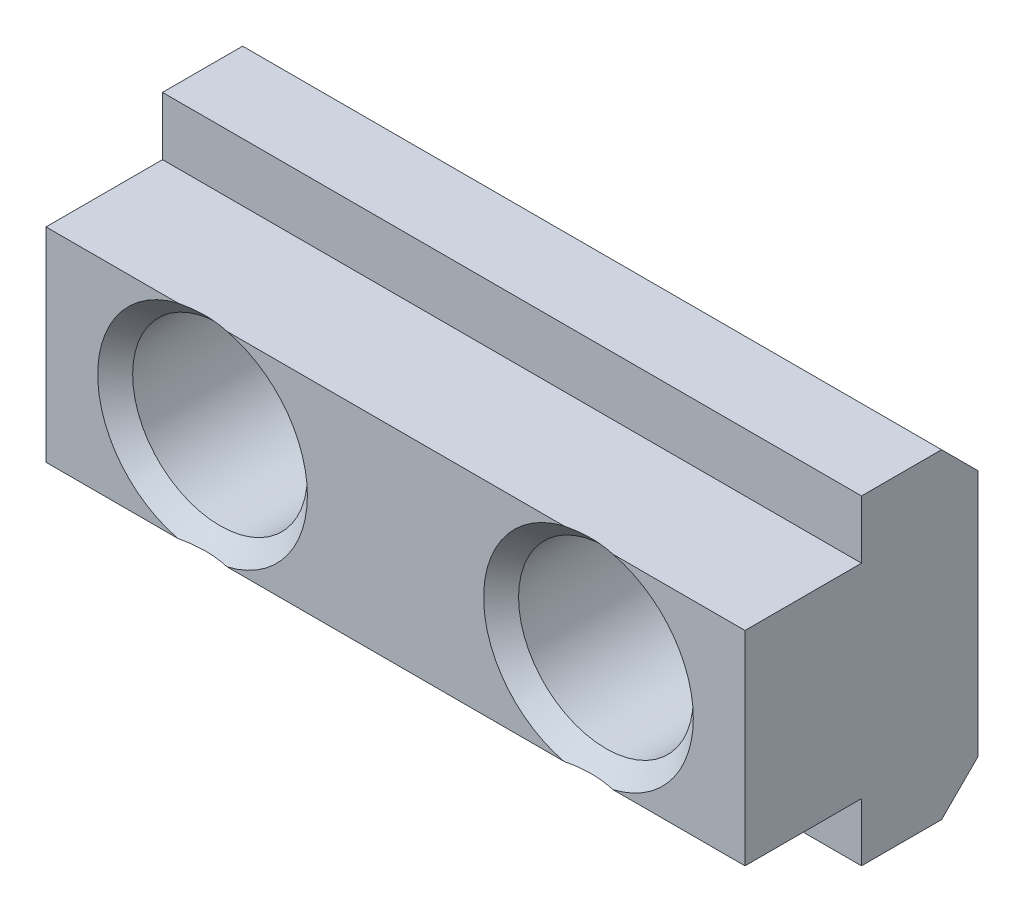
ISO-10303-21;
HEADER;
FILE_DESCRIPTION(('STEP AP214'),'2;1');
FILE_NAME('part.step','',(''),(''),'','','');
FILE_SCHEMA(('AUTOMOTIVE_DESIGN { 1 0 10303 214 1 1 1 1 }'));
ENDSEC;
DATA;
#1=APPLICATION_CONTEXT('core data for automotive mechanical design processes');
#2=APPLICATION_PROTOCOL_DEFINITION('international standard','automotive_design',2000,#1);
#3=PRODUCT_CONTEXT('',#1,'mechanical');
#4=PRODUCT('Part','Part','',(#3));
#5=PRODUCT_RELATED_PRODUCT_CATEGORY('part','',(#4));
#6=PRODUCT_DEFINITION_FORMATION('','',#4);
#7=PRODUCT_DEFINITION_CONTEXT('part definition',#1,'design');
#8=PRODUCT_DEFINITION('design','',#6,#7);
#9=PRODUCT_DEFINITION_SHAPE('','',#8);
#10=(LENGTH_UNIT() NAMED_UNIT(*) SI_UNIT(.MILLI.,.METRE.));
#11=(NAMED_UNIT(*) PLANE_ANGLE_UNIT() SI_UNIT($,.RADIAN.));
#12=(NAMED_UNIT(*) SI_UNIT($,.STERADIAN.) SOLID_ANGLE_UNIT());
#13=UNCERTAINTY_MEASURE_WITH_UNIT(LENGTH_MEASURE(1.E-05),#10,'distance_accuracy_value','');
#14=(GEOMETRIC_REPRESENTATION_CONTEXT(3) GLOBAL_UNCERTAINTY_ASSIGNED_CONTEXT((#13)) GLOBAL_UNIT_ASSIGNED_CONTEXT((#10,
#11,#12)) REPRESENTATION_CONTEXT('',''));
#15=CARTESIAN_POINT('',(0.,0.,0.));
#16=DIRECTION('',(0.,0.,1.));
#17=DIRECTION('',(1.,0.,0.));
#18=AXIS2_PLACEMENT_3D('',#15,#16,#17);
#19=CARTESIAN_POINT('',(37.25,-7.,16.));
#20=DIRECTION('',(0.,0.,-1.));
#21=DIRECTION('',(-1.,0.,0.));
#22=AXIS2_PLACEMENT_3D('',#19,#20,#21);
#23=PLANE('',#22);
#24=DIRECTION('',(-1.,0.,0.));
#25=VECTOR('',#24,1.);
#26=CARTESIAN_POINT('',(37.25,7.,16.));
#27=LINE('',#26,#25);
#28=CARTESIAN_POINT('',(24.8147700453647,7.,16.));
#29=VERTEX_POINT('',#28);
#30=CARTESIAN_POINT('',(1.68522995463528,7.,16.));
#31=VERTEX_POINT('',#30);
#32=EDGE_CURVE('E135',#29,#31,#27,.T.);
#33=ORIENTED_EDGE('',*,*,#32,.T.);
#34=CARTESIAN_POINT('',(0.,0.,16.));
#35=DIRECTION('',(0.,0.,1.));
#36=DIRECTION('',(1.,0.,0.));
#37=AXIS2_PLACEMENT_3D('',#34,#35,#36);
#38=CIRCLE('',#37,7.2);
#39=CARTESIAN_POINT('',(1.68522995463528,-7.,16.));
#40=VERTEX_POINT('',#39);
#41=EDGE_CURVE('E31',#40,#31,#38,.T.);
#42=ORIENTED_EDGE('',*,*,#41,.F.);
#43=DIRECTION('',(-1.,0.,0.));
#44=VECTOR('',#43,1.);
#45=CARTESIAN_POINT('',(37.25,-7.,16.));
#46=LINE('',#45,#44);
#47=CARTESIAN_POINT('',(24.8147700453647,-7.,16.));
#48=VERTEX_POINT('',#47);
#49=EDGE_CURVE('E140',#48,#40,#46,.T.);
#50=ORIENTED_EDGE('',*,*,#49,.F.);
#51=CARTESIAN_POINT('',(26.5,0.,16.));
#52=DIRECTION('',(0.,0.,1.));
#53=DIRECTION('',(1.,0.,0.));
#54=AXIS2_PLACEMENT_3D('',#51,#52,#53);
#55=CIRCLE('',#54,7.2);
#56=EDGE_CURVE('E345',#29,#48,#55,.T.);
#57=ORIENTED_EDGE('',*,*,#56,.F.);
#58=EDGE_LOOP('',(#33,#42,#50,#57));
#59=FACE_BOUND('',#58,.T.);
#60=ADVANCED_FACE('F14',(#59),#23,.F.);
#61=CARTESIAN_POINT('',(37.25,7.,16.));
#62=VERTEX_POINT('',#61);
#63=CARTESIAN_POINT('',(28.1852299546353,7.,16.));
#64=VERTEX_POINT('',#63);
#65=EDGE_CURVE('E138',#62,#64,#27,.T.);
#66=ORIENTED_EDGE('',*,*,#65,.T.);
#67=CARTESIAN_POINT('',(28.1852299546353,-7.,16.));
#68=VERTEX_POINT('',#67);
#69=EDGE_CURVE('E38',#68,#64,#55,.T.);
#70=ORIENTED_EDGE('',*,*,#69,.F.);
#71=CARTESIAN_POINT('',(37.25,-7.,16.));
#72=VERTEX_POINT('',#71);
#73=EDGE_CURVE('E136',#72,#68,#46,.T.);
#74=ORIENTED_EDGE('',*,*,#73,.F.);
#75=DIRECTION('',(0.,-1.,0.));
#76=VECTOR('',#75,1.);
#77=CARTESIAN_POINT('',(37.25,-7.,16.));
#78=LINE('',#77,#76);
#79=EDGE_CURVE('E326',#62,#72,#78,.T.);
#80=ORIENTED_EDGE('',*,*,#79,.F.);
#81=EDGE_LOOP('',(#66,#70,#74,#80));
#82=FACE_BOUND('',#81,.T.);
#83=ADVANCED_FACE('F222',(#82),#23,.F.);
#84=CARTESIAN_POINT('',(37.25,-7.,8.));
#85=DIRECTION('',(0.,1.,0.));
#86=DIRECTION('',(0.,0.,1.));
#87=AXIS2_PLACEMENT_3D('',#84,#85,#86);
#88=PLANE('',#87);
#89=ORIENTED_EDGE('',*,*,#49,.T.);
#90=CARTESIAN_POINT('',(-15.1421587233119,-7.,25.4818755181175));
#91=CARTESIAN_POINT('',(-14.8204639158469,-7.,25.1899035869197));
#92=CARTESIAN_POINT('',(-14.4979803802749,-7.,24.8987948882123));
#93=CARTESIAN_POINT('',(-13.8510551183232,-7.,24.3187289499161));
#94=CARTESIAN_POINT('',(-13.5266132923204,-7.,24.0297718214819));
#95=CARTESIAN_POINT('',(-12.8746738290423,-7.,23.4538016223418));
#96=CARTESIAN_POINT('',(-12.5471708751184,-7.,23.1667945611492));
#97=CARTESIAN_POINT('',(-11.889362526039,-7.,22.596020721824));
#98=CARTESIAN_POINT('',(-11.559057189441,-7.,22.3122538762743));
#99=CARTESIAN_POINT('',(-10.8647742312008,-7.,21.7231002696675));
#100=CARTESIAN_POINT('',(-10.5004694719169,-7.,21.4180979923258));
#101=CARTESIAN_POINT('',(-9.7667046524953,-7.,20.8143673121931));
#102=CARTESIAN_POINT('',(-9.39724474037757,-7.,20.5156387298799));
#103=CARTESIAN_POINT('',(-8.65208286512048,-7.,19.9268267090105));
#104=CARTESIAN_POINT('',(-8.27638784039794,-7.,19.6367345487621));
#105=CARTESIAN_POINT('',(-7.70641106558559,-7.,19.2102355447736));
#106=CARTESIAN_POINT('',(-7.51535589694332,-7.,19.0695157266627));
#107=CARTESIAN_POINT('',(-7.1307697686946,-7.,18.7915058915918));
#108=CARTESIAN_POINT('',(-6.93723888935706,-7.,18.6542157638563));
#109=CARTESIAN_POINT('',(-6.54103145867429,-7.,18.3793570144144));
#110=CARTESIAN_POINT('',(-6.33826145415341,-7.,18.241922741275));
#111=CARTESIAN_POINT('',(-5.92923551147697,-7.,17.9723589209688));
#112=CARTESIAN_POINT('',(-5.72297983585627,-7.,17.8402289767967));
#113=CARTESIAN_POINT('',(-5.30612760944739,-7.,17.5822627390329));
#114=CARTESIAN_POINT('',(-5.09552505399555,-7.,17.4564361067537));
#115=CARTESIAN_POINT('',(-4.66970146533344,-7.,17.2128242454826));
#116=CARTESIAN_POINT('',(-4.45448057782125,-7.,17.0950387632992));
#117=CARTESIAN_POINT('',(-4.02387341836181,-7.,16.8720766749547));
#118=CARTESIAN_POINT('',(-3.80860643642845,-7.,16.766671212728));
#119=CARTESIAN_POINT('',(-3.37258712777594,-7.,16.5676715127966));
#120=CARTESIAN_POINT('',(-3.15183389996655,-7.,16.4740792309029));
#121=CARTESIAN_POINT('',(-2.70527723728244,-7.,16.3017486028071));
#122=CARTESIAN_POINT('',(-2.47949020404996,-7.,16.2229681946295));
#123=CARTESIAN_POINT('',(-2.02256718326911,-7.,16.0831026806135));
#124=CARTESIAN_POINT('',(-1.7914349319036,-7.,16.0220055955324));
#125=CARTESIAN_POINT('',(-1.38449332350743,-7.,15.9335898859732));
#126=CARTESIAN_POINT('',(-1.20969162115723,-7.,15.9016271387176));
#127=CARTESIAN_POINT('',(-0.858214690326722,-7.,15.8502715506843));
#128=CARTESIAN_POINT('',(-0.681539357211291,-7.,15.8308794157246));
#129=CARTESIAN_POINT('',(-0.327438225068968,-7.,15.8054319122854));
#130=CARTESIAN_POINT('',(-0.150013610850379,-7.,15.799360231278));
#131=CARTESIAN_POINT('',(0.204782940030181,-7.,15.8007468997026));
#132=CARTESIAN_POINT('',(0.382154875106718,-7.,15.8082056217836));
#133=CARTESIAN_POINT('',(0.760835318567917,-7.,15.8383530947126));
#134=CARTESIAN_POINT('',(0.961985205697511,-7.,15.8630446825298));
#135=CARTESIAN_POINT('',(1.36166781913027,-7.,15.9284796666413));
#136=CARTESIAN_POINT('',(1.56019982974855,-7.,15.9692273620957));
#137=CARTESIAN_POINT('',(1.95567223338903,-7.,16.0654999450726));
#138=CARTESIAN_POINT('',(2.15257794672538,-7.,16.121165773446));
#139=CARTESIAN_POINT('',(2.54229380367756,-7.,16.2450734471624));
#140=CARTESIAN_POINT('',(2.73510486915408,-7.,16.3133124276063));
#141=CARTESIAN_POINT('',(3.19310231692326,-7.,16.4899315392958));
#142=CARTESIAN_POINT('',(3.45630667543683,-7.,16.6034353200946));
#143=CARTESIAN_POINT('',(3.97515242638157,-7.,16.8466935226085));
#144=CARTESIAN_POINT('',(4.23078943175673,-7.,16.9764571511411));
#145=CARTESIAN_POINT('',(4.73619090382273,-7.,17.2490273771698));
#146=CARTESIAN_POINT('',(4.98592990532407,-7.,17.3918808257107));
#147=CARTESIAN_POINT('',(5.47944476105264,-7.,17.6873659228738));
#148=CARTESIAN_POINT('',(5.72322179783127,-7.,17.8399956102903));
#149=CARTESIAN_POINT('',(6.19422927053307,-7.,18.1454758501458));
#150=CARTESIAN_POINT('',(6.42169376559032,-7.,18.2979673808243));
#151=CARTESIAN_POINT('',(6.87276429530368,-7.,18.6085759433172));
#152=CARTESIAN_POINT('',(7.09637001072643,-7.,18.7666934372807));
#153=CARTESIAN_POINT('',(7.5382934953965,-7.,19.0860440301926));
#154=CARTESIAN_POINT('',(7.75664068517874,-7.,19.2472365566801));
#155=CARTESIAN_POINT('',(8.19048786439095,-7.,19.5732938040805));
#156=CARTESIAN_POINT('',(8.40598859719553,-7.,19.7381575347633));
#157=CARTESIAN_POINT('',(8.62032140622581,-7.,19.9045009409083));
#158=B_SPLINE_CURVE_WITH_KNOTS('',3,(#90,#91,#92,#93,#94,#95,#96,#97,#98,#99,#100,#101,#102,
#103,#104,#105,#106,#107,#108,#109,#110,#111,#112,#113,#114,#115,#116,#117,#118,#119,#120,#121,
#122,#123,#124,#125,#126,#127,#128,#129,#130,#131,#132,#133,#134,#135,#136,#137,#138,#139,#140,
#141,#142,#143,#144,#145,#146,#147,#148,#149,#150,#151,#152,#153,#154,#155,#156,#157),
.UNSPECIFIED.,.F.,.F.,(4,2,2,2,2,2,2,2,2,2,2,2,2,2,2,2,2,2,2,2,2,2,2,2,2,2,2,2,2,2,2,2,2,4),(0.,
1.30331399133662,2.6066948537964,3.91307731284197,5.21943254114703,6.6447540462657,
8.07003470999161,9.4938235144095,10.2056485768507,10.917450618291,11.6522530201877,
12.3870003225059,13.1228413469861,13.8586591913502,14.5774341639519,15.2963279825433,
16.0131484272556,16.7294821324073,17.2621752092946,17.7948981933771,18.3269684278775,
18.8590533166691,19.4663117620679,20.0737329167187,20.6871084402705,21.3003443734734,
22.159490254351,23.019124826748,23.8819662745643,24.7446351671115,25.5660842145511,
26.387600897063,27.201761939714,28.0157059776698),.UNSPECIFIED.);
#159=CARTESIAN_POINT('',(-1.68522995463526,-7.,16.));
#160=VERTEX_POINT('',#159);
#161=EDGE_CURVE('E228',#40,#160,#158,.F.);
#162=ORIENTED_EDGE('',*,*,#161,.T.);
#163=CARTESIAN_POINT('',(-10.75,-7.,16.));
#164=VERTEX_POINT('',#163);
#165=EDGE_CURVE('E127',#160,#164,#46,.T.);
#166=ORIENTED_EDGE('',*,*,#165,.T.);
#167=DIRECTION('',(0.,0.,-1.));
#168=VECTOR('',#167,1.);
#169=CARTESIAN_POINT('',(-10.75,-7.,8.));
#170=LINE('',#169,#168);
#171=CARTESIAN_POINT('',(-10.75,-7.,8.));
#172=VERTEX_POINT('',#171);
#173=EDGE_CURVE('E212',#164,#172,#170,.T.);
#174=ORIENTED_EDGE('',*,*,#173,.T.);
#175=DIRECTION('',(-1.,0.,0.));
#176=VECTOR('',#175,1.);
#177=CARTESIAN_POINT('',(37.25,-7.,8.));
#178=LINE('',#177,#176);
#179=CARTESIAN_POINT('',(37.25,-7.,8.));
#180=VERTEX_POINT('',#179);
#181=EDGE_CURVE('E157',#180,#172,#178,.T.);
#182=ORIENTED_EDGE('',*,*,#181,.F.);
#183=DIRECTION('',(0.,0.,-1.));
#184=VECTOR('',#183,1.);
#185=CARTESIAN_POINT('',(37.25,-7.,8.));
#186=LINE('',#185,#184);
#187=EDGE_CURVE('E215',#72,#180,#186,.T.);
#188=ORIENTED_EDGE('',*,*,#187,.F.);
#189=ORIENTED_EDGE('',*,*,#73,.T.);
#190=CARTESIAN_POINT('',(11.3578412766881,-7.,25.4818755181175));
#191=CARTESIAN_POINT('',(11.6795360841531,-7.,25.1899035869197));
#192=CARTESIAN_POINT('',(12.002019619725,-7.,24.8987948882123));
#193=CARTESIAN_POINT('',(12.6489448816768,-7.,24.3187289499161));
#194=CARTESIAN_POINT('',(12.9733867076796,-7.,24.0297718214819));
#195=CARTESIAN_POINT('',(13.6253261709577,-7.,23.4538016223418));
#196=CARTESIAN_POINT('',(13.9528291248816,-7.,23.1667945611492));
#197=CARTESIAN_POINT('',(14.610637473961,-7.,22.596020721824));
#198=CARTESIAN_POINT('',(14.940942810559,-7.,22.3122538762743));
#199=CARTESIAN_POINT('',(15.6352257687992,-7.,21.7231002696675));
#200=CARTESIAN_POINT('',(15.9995305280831,-7.,21.4180979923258));
#201=CARTESIAN_POINT('',(16.7332953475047,-7.,20.8143673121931));
#202=CARTESIAN_POINT('',(17.1027552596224,-7.,20.5156387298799));
#203=CARTESIAN_POINT('',(17.8479171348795,-7.,19.9268267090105));
#204=CARTESIAN_POINT('',(18.2236121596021,-7.,19.6367345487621));
#205=CARTESIAN_POINT('',(18.7935889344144,-7.,19.2102355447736));
#206=CARTESIAN_POINT('',(18.9846441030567,-7.,19.0695157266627));
#207=CARTESIAN_POINT('',(19.3692302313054,-7.,18.7915058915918));
#208=CARTESIAN_POINT('',(19.5627611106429,-7.,18.6542157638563));
#209=CARTESIAN_POINT('',(19.9589685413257,-7.,18.3793570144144));
#210=CARTESIAN_POINT('',(20.1617385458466,-7.,18.241922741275));
#211=CARTESIAN_POINT('',(20.570764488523,-7.,17.9723589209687));
#212=CARTESIAN_POINT('',(20.7770201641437,-7.,17.8402289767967));
#213=CARTESIAN_POINT('',(21.1938723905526,-7.,17.5822627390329));
#214=CARTESIAN_POINT('',(21.4044749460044,-7.,17.4564361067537));
#215=CARTESIAN_POINT('',(21.8302985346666,-7.,17.2128242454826));
#216=CARTESIAN_POINT('',(22.0455194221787,-7.,17.0950387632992));
#217=CARTESIAN_POINT('',(22.4761265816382,-7.,16.8720766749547));
#218=CARTESIAN_POINT('',(22.6913935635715,-7.,16.766671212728));
#219=CARTESIAN_POINT('',(23.1274128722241,-7.,16.5676715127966));
#220=CARTESIAN_POINT('',(23.3481661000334,-7.,16.4740792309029));
#221=CARTESIAN_POINT('',(23.7947227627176,-7.,16.3017486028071));
#222=CARTESIAN_POINT('',(24.02050979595,-7.,16.2229681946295));
#223=CARTESIAN_POINT('',(24.4774328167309,-7.,16.0831026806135));
#224=CARTESIAN_POINT('',(24.7085650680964,-7.,16.0220055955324));
#225=CARTESIAN_POINT('',(25.1155066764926,-7.,15.9335898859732));
#226=CARTESIAN_POINT('',(25.2903083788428,-7.,15.9016271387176));
#227=CARTESIAN_POINT('',(25.6417853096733,-7.,15.8502715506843));
#228=CARTESIAN_POINT('',(25.8184606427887,-7.,15.8308794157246));
#229=CARTESIAN_POINT('',(26.172561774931,-7.,15.8054319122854));
#230=CARTESIAN_POINT('',(26.3499863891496,-7.,15.799360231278));
#231=CARTESIAN_POINT('',(26.7047829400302,-7.,15.8007468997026));
#232=CARTESIAN_POINT('',(26.8821548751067,-7.,15.8082056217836));
#233=CARTESIAN_POINT('',(27.2608353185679,-7.,15.8383530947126));
#234=CARTESIAN_POINT('',(27.4619852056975,-7.,15.8630446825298));
#235=CARTESIAN_POINT('',(27.8616678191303,-7.,15.9284796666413));
#236=CARTESIAN_POINT('',(28.0601998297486,-7.,15.9692273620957));
#237=CARTESIAN_POINT('',(28.455672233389,-7.,16.0654999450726));
#238=CARTESIAN_POINT('',(28.6525779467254,-7.,16.121165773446));
#239=CARTESIAN_POINT('',(29.0422938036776,-7.,16.2450734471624));
#240=CARTESIAN_POINT('',(29.2351048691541,-7.,16.3133124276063));
#241=CARTESIAN_POINT('',(29.6931023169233,-7.,16.4899315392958));
#242=CARTESIAN_POINT('',(29.9563066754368,-7.,16.6034353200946));
#243=CARTESIAN_POINT('',(30.4751524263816,-7.,16.8466935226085));
#244=CARTESIAN_POINT('',(30.7307894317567,-7.,16.9764571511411));
#245=CARTESIAN_POINT('',(31.2361909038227,-7.,17.2490273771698));
#246=CARTESIAN_POINT('',(31.4859299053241,-7.,17.3918808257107));
#247=CARTESIAN_POINT('',(31.9794447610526,-7.,17.6873659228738));
#248=CARTESIAN_POINT('',(32.2232217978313,-7.,17.8399956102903));
#249=CARTESIAN_POINT('',(32.6942292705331,-7.,18.1454758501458));
#250=CARTESIAN_POINT('',(32.9216937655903,-7.,18.2979673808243));
#251=CARTESIAN_POINT('',(33.3727642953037,-7.,18.6085759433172));
#252=CARTESIAN_POINT('',(33.5963700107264,-7.,18.7666934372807));
#253=CARTESIAN_POINT('',(34.0382934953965,-7.,19.0860440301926));
#254=CARTESIAN_POINT('',(34.2566406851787,-7.,19.2472365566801));
#255=CARTESIAN_POINT('',(34.6904878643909,-7.,19.5732938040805));
#256=CARTESIAN_POINT('',(34.9059885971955,-7.,19.7381575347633));
#257=CARTESIAN_POINT('',(35.1203214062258,-7.,19.9045009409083));
#258=B_SPLINE_CURVE_WITH_KNOTS('',3,(#190,#191,#192,#193,#194,#195,#196,#197,#198,#199,#200,
#201,#202,#203,#204,#205,#206,#207,#208,#209,#210,#211,#212,#213,#214,#215,#216,#217,#218,#219,
#220,#221,#222,#223,#224,#225,#226,#227,#228,#229,#230,#231,#232,#233,#234,#235,#236,#237,#238,
#239,#240,#241,#242,#243,#244,#245,#246,#247,#248,#249,#250,#251,#252,#253,#254,#255,#256,#257),
.UNSPECIFIED.,.F.,.F.,(4,2,2,2,2,2,2,2,2,2,2,2,2,2,2,2,2,2,2,2,2,2,2,2,2,2,2,2,2,2,2,2,2,4),(0.,
1.30331399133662,2.6066948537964,3.91307731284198,5.21943254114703,6.6447540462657,
8.07003470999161,9.49382351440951,10.2056485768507,10.917450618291,11.6522530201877,
12.3870003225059,13.1228413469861,13.8586591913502,14.5774341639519,15.2963279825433,
16.0131484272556,16.7294821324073,17.2621752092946,17.7948981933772,18.3269684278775,
18.8590533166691,19.466311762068,20.0737329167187,20.6871084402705,21.3003443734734,
22.159490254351,23.019124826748,23.8819662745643,24.7446351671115,25.5660842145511,
26.387600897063,27.201761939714,28.0157059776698),.UNSPECIFIED.);
#259=EDGE_CURVE('E203',#68,#48,#258,.F.);
#260=ORIENTED_EDGE('',*,*,#259,.T.);
#261=EDGE_LOOP('',(#89,#162,#166,#174,#182,#188,#189,#260));
#262=FACE_BOUND('',#261,.T.);
#263=ADVANCED_FACE('F217',(#262),#88,.F.);
#264=CARTESIAN_POINT('',(37.25,-11.,8.));
#265=DIRECTION('',(0.,0.,-1.));
#266=DIRECTION('',(-1.,0.,0.));
#267=AXIS2_PLACEMENT_3D('',#264,#265,#266);
#268=PLANE('',#267);
#269=DIRECTION('',(0.,-1.,0.));
#270=VECTOR('',#269,1.);
#271=CARTESIAN_POINT('',(-10.75,-11.,8.));
#272=LINE('',#271,#270);
#273=CARTESIAN_POINT('',(-10.75,-11.,8.));
#274=VERTEX_POINT('',#273);
#275=EDGE_CURVE('E302',#172,#274,#272,.T.);
#276=ORIENTED_EDGE('',*,*,#275,.T.);
#277=DIRECTION('',(-1.,0.,0.));
#278=VECTOR('',#277,1.);
#279=CARTESIAN_POINT('',(37.25,-11.,8.));
#280=LINE('',#279,#278);
#281=CARTESIAN_POINT('',(37.25,-11.,8.));
#282=VERTEX_POINT('',#281);
#283=EDGE_CURVE('E152',#282,#274,#280,.T.);
#284=ORIENTED_EDGE('',*,*,#283,.F.);
#285=DIRECTION('',(0.,-1.,0.));
#286=VECTOR('',#285,1.);
#287=CARTESIAN_POINT('',(37.25,-11.,8.));
#288=LINE('',#287,#286);
#289=EDGE_CURVE('E320',#180,#282,#288,.T.);
#290=ORIENTED_EDGE('',*,*,#289,.F.);
#291=ORIENTED_EDGE('',*,*,#181,.T.);
#292=EDGE_LOOP('',(#276,#284,#290,#291));
#293=FACE_BOUND('',#292,.T.);
#294=ADVANCED_FACE('F221',(#293),#268,.F.);
#295=CARTESIAN_POINT('',(37.25,-11.,0.));
#296=DIRECTION('',(0.,1.,0.));
#297=DIRECTION('',(0.,0.,1.));
#298=AXIS2_PLACEMENT_3D('',#295,#296,#297);
#299=PLANE('',#298);
#300=DIRECTION('',(0.,0.,-1.));
#301=VECTOR('',#300,1.);
#302=CARTESIAN_POINT('',(-10.75,-11.,0.));
#303=LINE('',#302,#301);
#304=CARTESIAN_POINT('',(-10.75,-11.,2.5));
#305=VERTEX_POINT('',#304);
#306=EDGE_CURVE('E295',#274,#305,#303,.T.);
#307=ORIENTED_EDGE('',*,*,#306,.T.);
#308=DIRECTION('',(1.,0.,0.));
#309=VECTOR('',#308,1.);
#310=CARTESIAN_POINT('',(37.25,-11.,2.5));
#311=LINE('',#310,#309);
#312=CARTESIAN_POINT('',(37.25,-11.,2.5));
#313=VERTEX_POINT('',#312);
#314=EDGE_CURVE('E169',#305,#313,#311,.T.);
#315=ORIENTED_EDGE('',*,*,#314,.T.);
#316=DIRECTION('',(0.,0.,-1.));
#317=VECTOR('',#316,1.);
#318=CARTESIAN_POINT('',(37.25,-11.,0.));
#319=LINE('',#318,#317);
#320=EDGE_CURVE('E311',#282,#313,#319,.T.);
#321=ORIENTED_EDGE('',*,*,#320,.F.);
#322=ORIENTED_EDGE('',*,*,#283,.T.);
#323=EDGE_LOOP('',(#307,#315,#321,#322));
#324=FACE_BOUND('',#323,.T.);
#325=ADVANCED_FACE('F284',(#324),#299,.F.);
#326=CARTESIAN_POINT('',(37.25,11.,0.));
#327=DIRECTION('',(0.,0.,1.));
#328=DIRECTION('',(0.,-1.,0.));
#329=AXIS2_PLACEMENT_3D('',#326,#327,#328);
#330=PLANE('',#329);
#331=CARTESIAN_POINT('',(0.,0.,0.));
#332=DIRECTION('',(0.,0.,1.));
#333=DIRECTION('',(1.,0.,0.));
#334=AXIS2_PLACEMENT_3D('',#331,#332,#333);
#335=CIRCLE('',#334,7.2);
#336=CARTESIAN_POINT('',(7.2,0.,0.));
#337=VERTEX_POINT('',#336);
#338=EDGE_CURVE('E128',#337,#337,#335,.T.);
#339=ORIENTED_EDGE('',*,*,#338,.T.);
#340=EDGE_LOOP('',(#339));
#341=FACE_BOUND('',#340,.T.);
#342=CARTESIAN_POINT('',(26.5,0.,0.));
#343=DIRECTION('',(0.,0.,1.));
#344=DIRECTION('',(1.,0.,0.));
#345=AXIS2_PLACEMENT_3D('',#342,#343,#344);
#346=CIRCLE('',#345,7.2);
#347=CARTESIAN_POINT('',(33.7,0.,0.));
#348=VERTEX_POINT('',#347);
#349=EDGE_CURVE('E213',#348,#348,#346,.T.);
#350=ORIENTED_EDGE('',*,*,#349,.T.);
#351=EDGE_LOOP('',(#350));
#352=FACE_BOUND('',#351,.T.);
#353=DIRECTION('',(0.,1.,0.));
#354=VECTOR('',#353,1.);
#355=CARTESIAN_POINT('',(37.25,11.,0.));
#356=LINE('',#355,#354);
#357=CARTESIAN_POINT('',(37.25,-8.5,0.));
#358=VERTEX_POINT('',#357);
#359=CARTESIAN_POINT('',(37.25,8.5,0.));
#360=VERTEX_POINT('',#359);
#361=EDGE_CURVE('E309',#358,#360,#356,.T.);
#362=ORIENTED_EDGE('',*,*,#361,.F.);
#363=DIRECTION('',(-1.,0.,0.));
#364=VECTOR('',#363,1.);
#365=CARTESIAN_POINT('',(37.25,-8.5,0.));
#366=LINE('',#365,#364);
#367=CARTESIAN_POINT('',(-10.75,-8.5,0.));
#368=VERTEX_POINT('',#367);
#369=EDGE_CURVE('E162',#358,#368,#366,.T.);
#370=ORIENTED_EDGE('',*,*,#369,.T.);
#371=DIRECTION('',(0.,1.,0.));
#372=VECTOR('',#371,1.);
#373=CARTESIAN_POINT('',(-10.75,11.,0.));
#374=LINE('',#373,#372);
#375=CARTESIAN_POINT('',(-10.75,8.5,0.));
#376=VERTEX_POINT('',#375);
#377=EDGE_CURVE('E301',#368,#376,#374,.T.);
#378=ORIENTED_EDGE('',*,*,#377,.T.);
#379=DIRECTION('',(1.,0.,0.));
#380=VECTOR('',#379,1.);
#381=CARTESIAN_POINT('',(37.25,8.5,0.));
#382=LINE('',#381,#380);
#383=EDGE_CURVE('E160',#376,#360,#382,.T.);
#384=ORIENTED_EDGE('',*,*,#383,.T.);
#385=EDGE_LOOP('',(#362,#370,#378,#384));
#386=FACE_BOUND('',#385,.T.);
#387=ADVANCED_FACE('F279',(#341,#352,#386),#330,.F.);
#388=CARTESIAN_POINT('',(37.25,11.,8.));
#389=DIRECTION('',(0.,-1.,0.));
#390=DIRECTION('',(0.,0.,-1.));
#391=AXIS2_PLACEMENT_3D('',#388,#389,#390);
#392=PLANE('',#391);
#393=DIRECTION('',(0.,0.,1.));
#394=VECTOR('',#393,1.);
#395=CARTESIAN_POINT('',(37.25,11.,8.));
#396=LINE('',#395,#394);
#397=CARTESIAN_POINT('',(37.25,11.,2.5));
#398=VERTEX_POINT('',#397);
#399=CARTESIAN_POINT('',(37.25,11.,8.));
#400=VERTEX_POINT('',#399);
#401=EDGE_CURVE('E316',#398,#400,#396,.T.);
#402=ORIENTED_EDGE('',*,*,#401,.F.);
#403=DIRECTION('',(-1.,0.,0.));
#404=VECTOR('',#403,1.);
#405=CARTESIAN_POINT('',(37.25,11.,2.5));
#406=LINE('',#405,#404);
#407=CARTESIAN_POINT('',(-10.75,11.,2.5));
#408=VERTEX_POINT('',#407);
#409=EDGE_CURVE('E175',#398,#408,#406,.T.);
#410=ORIENTED_EDGE('',*,*,#409,.T.);
#411=DIRECTION('',(0.,0.,1.));
#412=VECTOR('',#411,1.);
#413=CARTESIAN_POINT('',(-10.75,11.,8.));
#414=LINE('',#413,#412);
#415=CARTESIAN_POINT('',(-10.75,11.,8.));
#416=VERTEX_POINT('',#415);
#417=EDGE_CURVE('E332',#408,#416,#414,.T.);
#418=ORIENTED_EDGE('',*,*,#417,.T.);
#419=DIRECTION('',(-1.,0.,0.));
#420=VECTOR('',#419,1.);
#421=CARTESIAN_POINT('',(37.25,11.,8.));
#422=LINE('',#421,#420);
#423=EDGE_CURVE('E148',#400,#416,#422,.T.);
#424=ORIENTED_EDGE('',*,*,#423,.F.);
#425=EDGE_LOOP('',(#402,#410,#418,#424));
#426=FACE_BOUND('',#425,.T.);
#427=ADVANCED_FACE('F273',(#426),#392,.F.);
#428=CARTESIAN_POINT('',(37.25,7.,8.));
#429=DIRECTION('',(0.,0.,-1.));
#430=DIRECTION('',(-1.,0.,0.));
#431=AXIS2_PLACEMENT_3D('',#428,#429,#430);
#432=PLANE('',#431);
#433=DIRECTION('',(0.,-1.,0.));
#434=VECTOR('',#433,1.);
#435=CARTESIAN_POINT('',(-10.75,7.,8.));
#436=LINE('',#435,#434);
#437=CARTESIAN_POINT('',(-10.75,7.,8.));
#438=VERTEX_POINT('',#437);
#439=EDGE_CURVE('E334',#416,#438,#436,.T.);
#440=ORIENTED_EDGE('',*,*,#439,.T.);
#441=DIRECTION('',(-1.,0.,0.));
#442=VECTOR('',#441,1.);
#443=CARTESIAN_POINT('',(37.25,7.,8.));
#444=LINE('',#443,#442);
#445=CARTESIAN_POINT('',(37.25,7.,8.));
#446=VERTEX_POINT('',#445);
#447=EDGE_CURVE('E144',#446,#438,#444,.T.);
#448=ORIENTED_EDGE('',*,*,#447,.F.);
#449=DIRECTION('',(0.,-1.,0.));
#450=VECTOR('',#449,1.);
#451=CARTESIAN_POINT('',(37.25,7.,8.));
#452=LINE('',#451,#450);
#453=EDGE_CURVE('E318',#400,#446,#452,.T.);
#454=ORIENTED_EDGE('',*,*,#453,.F.);
#455=ORIENTED_EDGE('',*,*,#423,.T.);
#456=EDGE_LOOP('',(#440,#448,#454,#455));
#457=FACE_BOUND('',#456,.T.);
#458=ADVANCED_FACE('F268',(#457),#432,.F.);
#459=CARTESIAN_POINT('',(37.25,7.,16.));
#460=DIRECTION('',(0.,-1.,0.));
#461=DIRECTION('',(0.,0.,-1.));
#462=AXIS2_PLACEMENT_3D('',#459,#460,#461);
#463=PLANE('',#462);
#464=CARTESIAN_POINT('',(-1.68522995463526,7.,16.));
#465=VERTEX_POINT('',#464);
#466=CARTESIAN_POINT('',(-10.75,7.,16.));
#467=VERTEX_POINT('',#466);
#468=EDGE_CURVE('E125',#465,#467,#27,.T.);
#469=ORIENTED_EDGE('',*,*,#468,.F.);
#470=CARTESIAN_POINT('',(-15.1421587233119,7.,25.4818755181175));
#471=CARTESIAN_POINT('',(-14.8204639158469,7.,25.1899035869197));
#472=CARTESIAN_POINT('',(-14.4979803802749,7.,24.8987948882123));
#473=CARTESIAN_POINT('',(-13.8510551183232,7.,24.3187289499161));
#474=CARTESIAN_POINT('',(-13.5266132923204,7.,24.0297718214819));
#475=CARTESIAN_POINT('',(-12.8746738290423,7.,23.4538016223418));
#476=CARTESIAN_POINT('',(-12.5471708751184,7.,23.1667945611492));
#477=CARTESIAN_POINT('',(-11.889362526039,7.,22.596020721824));
#478=CARTESIAN_POINT('',(-11.559057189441,7.,22.3122538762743));
#479=CARTESIAN_POINT('',(-10.8647742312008,7.,21.7231002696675));
#480=CARTESIAN_POINT('',(-10.5004694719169,7.,21.4180979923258));
#481=CARTESIAN_POINT('',(-9.76670465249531,7.,20.8143673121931));
#482=CARTESIAN_POINT('',(-9.39724474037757,7.,20.5156387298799));
#483=CARTESIAN_POINT('',(-8.65208286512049,7.,19.9268267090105));
#484=CARTESIAN_POINT('',(-8.27638784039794,7.,19.6367345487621));
#485=CARTESIAN_POINT('',(-7.70641106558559,7.,19.2102355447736));
#486=CARTESIAN_POINT('',(-7.51535589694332,7.,19.0695157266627));
#487=CARTESIAN_POINT('',(-7.1307697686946,7.,18.7915058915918));
#488=CARTESIAN_POINT('',(-6.93723888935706,7.,18.6542157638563));
#489=CARTESIAN_POINT('',(-6.54103145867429,7.,18.3793570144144));
#490=CARTESIAN_POINT('',(-6.33826145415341,7.,18.241922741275));
#491=CARTESIAN_POINT('',(-5.92923551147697,7.,17.9723589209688));
#492=CARTESIAN_POINT('',(-5.72297983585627,7.,17.8402289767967));
#493=CARTESIAN_POINT('',(-5.30612760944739,7.,17.5822627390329));
#494=CARTESIAN_POINT('',(-5.09552505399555,7.,17.4564361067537));
#495=CARTESIAN_POINT('',(-4.66970146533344,7.,17.2128242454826));
#496=CARTESIAN_POINT('',(-4.45448057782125,7.,17.0950387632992));
#497=CARTESIAN_POINT('',(-4.02387341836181,7.,16.8720766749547));
#498=CARTESIAN_POINT('',(-3.80860643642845,7.,16.766671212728));
#499=CARTESIAN_POINT('',(-3.37258712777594,7.,16.5676715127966));
#500=CARTESIAN_POINT('',(-3.15183389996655,7.,16.4740792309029));
#501=CARTESIAN_POINT('',(-2.70527723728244,7.,16.3017486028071));
#502=CARTESIAN_POINT('',(-2.47949020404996,7.,16.2229681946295));
#503=CARTESIAN_POINT('',(-2.02256718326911,7.,16.0831026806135));
#504=CARTESIAN_POINT('',(-1.79143493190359,7.,16.0220055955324));
#505=CARTESIAN_POINT('',(-1.38449332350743,7.,15.9335898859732));
#506=CARTESIAN_POINT('',(-1.20969162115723,7.,15.9016271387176));
#507=CARTESIAN_POINT('',(-0.858214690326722,7.,15.8502715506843));
#508=CARTESIAN_POINT('',(-0.681539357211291,7.,15.8308794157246));
#509=CARTESIAN_POINT('',(-0.327438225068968,7.,15.8054319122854));
#510=CARTESIAN_POINT('',(-0.150013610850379,7.,15.799360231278));
#511=CARTESIAN_POINT('',(0.204782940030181,7.,15.8007468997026));
#512=CARTESIAN_POINT('',(0.382154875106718,7.,15.8082056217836));
#513=CARTESIAN_POINT('',(0.760835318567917,7.,15.8383530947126));
#514=CARTESIAN_POINT('',(0.961985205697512,7.,15.8630446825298));
#515=CARTESIAN_POINT('',(1.36166781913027,7.,15.9284796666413));
#516=CARTESIAN_POINT('',(1.56019982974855,7.,15.9692273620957));
#517=CARTESIAN_POINT('',(1.95567223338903,7.,16.0654999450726));
#518=CARTESIAN_POINT('',(2.15257794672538,7.,16.121165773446));
#519=CARTESIAN_POINT('',(2.54229380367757,7.,16.2450734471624));
#520=CARTESIAN_POINT('',(2.73510486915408,7.,16.3133124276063));
#521=CARTESIAN_POINT('',(3.19310231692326,7.,16.4899315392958));
#522=CARTESIAN_POINT('',(3.45630667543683,7.,16.6034353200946));
#523=CARTESIAN_POINT('',(3.97515242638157,7.,16.8466935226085));
#524=CARTESIAN_POINT('',(4.23078943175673,7.,16.9764571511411));
#525=CARTESIAN_POINT('',(4.73619090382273,7.,17.2490273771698));
#526=CARTESIAN_POINT('',(4.98592990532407,7.,17.3918808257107));
#527=CARTESIAN_POINT('',(5.47944476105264,7.,17.6873659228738));
#528=CARTESIAN_POINT('',(5.72322179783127,7.,17.8399956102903));
#529=CARTESIAN_POINT('',(6.19422927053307,7.,18.1454758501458));
#530=CARTESIAN_POINT('',(6.42169376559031,7.,18.2979673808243));
#531=CARTESIAN_POINT('',(6.87276429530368,7.,18.6085759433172));
#532=CARTESIAN_POINT('',(7.09637001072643,7.,18.7666934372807));
#533=CARTESIAN_POINT('',(7.5382934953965,7.,19.0860440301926));
#534=CARTESIAN_POINT('',(7.75664068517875,7.,19.2472365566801));
#535=CARTESIAN_POINT('',(8.19048786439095,7.,19.5732938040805));
#536=CARTESIAN_POINT('',(8.40598859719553,7.,19.7381575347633));
#537=CARTESIAN_POINT('',(8.62032140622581,7.,19.9045009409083));
#538=B_SPLINE_CURVE_WITH_KNOTS('',3,(#470,#471,#472,#473,#474,#475,#476,#477,#478,#479,#480,
#481,#482,#483,#484,#485,#486,#487,#488,#489,#490,#491,#492,#493,#494,#495,#496,#497,#498,#499,
#500,#501,#502,#503,#504,#505,#506,#507,#508,#509,#510,#511,#512,#513,#514,#515,#516,#517,#518,
#519,#520,#521,#522,#523,#524,#525,#526,#527,#528,#529,#530,#531,#532,#533,#534,#535,#536,#537),
.UNSPECIFIED.,.F.,.F.,(4,2,2,2,2,2,2,2,2,2,2,2,2,2,2,2,2,2,2,2,2,2,2,2,2,2,2,2,2,2,2,2,2,4),(0.,
1.30331399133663,2.6066948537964,3.91307731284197,5.21943254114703,6.6447540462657,
8.0700347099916,9.4938235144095,10.2056485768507,10.917450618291,11.6522530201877,
12.3870003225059,13.1228413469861,13.8586591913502,14.5774341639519,15.2963279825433,
16.0131484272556,16.7294821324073,17.2621752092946,17.7948981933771,18.3269684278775,
18.8590533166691,19.4663117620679,20.0737329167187,20.6871084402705,21.3003443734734,
22.159490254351,23.019124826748,23.8819662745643,24.7446351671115,25.5660842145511,
26.387600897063,27.201761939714,28.0157059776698),.UNSPECIFIED.);
#539=EDGE_CURVE('E9',#465,#31,#538,.T.);
#540=ORIENTED_EDGE('',*,*,#539,.T.);
#541=ORIENTED_EDGE('',*,*,#32,.F.);
#542=CARTESIAN_POINT('',(11.3578412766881,7.,25.4818755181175));
#543=CARTESIAN_POINT('',(11.6795360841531,7.,25.1899035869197));
#544=CARTESIAN_POINT('',(12.002019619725,7.,24.8987948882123));
#545=CARTESIAN_POINT('',(12.6489448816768,7.,24.3187289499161));
#546=CARTESIAN_POINT('',(12.9733867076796,7.,24.0297718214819));
#547=CARTESIAN_POINT('',(13.6253261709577,7.,23.4538016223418));
#548=CARTESIAN_POINT('',(13.9528291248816,7.,23.1667945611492));
#549=CARTESIAN_POINT('',(14.610637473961,7.,22.596020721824));
#550=CARTESIAN_POINT('',(14.940942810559,7.,22.3122538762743));
#551=CARTESIAN_POINT('',(15.6352257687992,7.,21.7231002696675));
#552=CARTESIAN_POINT('',(15.9995305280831,7.,21.4180979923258));
#553=CARTESIAN_POINT('',(16.7332953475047,7.,20.8143673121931));
#554=CARTESIAN_POINT('',(17.1027552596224,7.,20.5156387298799));
#555=CARTESIAN_POINT('',(17.8479171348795,7.,19.9268267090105));
#556=CARTESIAN_POINT('',(18.2236121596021,7.,19.6367345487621));
#557=CARTESIAN_POINT('',(18.7935889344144,7.,19.2102355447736));
#558=CARTESIAN_POINT('',(18.9846441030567,7.,19.0695157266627));
#559=CARTESIAN_POINT('',(19.3692302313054,7.,18.7915058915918));
#560=CARTESIAN_POINT('',(19.5627611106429,7.,18.6542157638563));
#561=CARTESIAN_POINT('',(19.9589685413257,7.,18.3793570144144));
#562=CARTESIAN_POINT('',(20.1617385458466,7.,18.241922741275));
#563=CARTESIAN_POINT('',(20.570764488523,7.,17.9723589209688));
#564=CARTESIAN_POINT('',(20.7770201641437,7.,17.8402289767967));
#565=CARTESIAN_POINT('',(21.1938723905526,7.,17.5822627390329));
#566=CARTESIAN_POINT('',(21.4044749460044,7.,17.4564361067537));
#567=CARTESIAN_POINT('',(21.8302985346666,7.,17.2128242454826));
#568=CARTESIAN_POINT('',(22.0455194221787,7.,17.0950387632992));
#569=CARTESIAN_POINT('',(22.4761265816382,7.,16.8720766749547));
#570=CARTESIAN_POINT('',(22.6913935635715,7.,16.766671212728));
#571=CARTESIAN_POINT('',(23.1274128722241,7.,16.5676715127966));
#572=CARTESIAN_POINT('',(23.3481661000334,7.,16.4740792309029));
#573=CARTESIAN_POINT('',(23.7947227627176,7.,16.3017486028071));
#574=CARTESIAN_POINT('',(24.02050979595,7.,16.2229681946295));
#575=CARTESIAN_POINT('',(24.4774328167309,7.,16.0831026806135));
#576=CARTESIAN_POINT('',(24.7085650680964,7.,16.0220055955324));
#577=CARTESIAN_POINT('',(25.1155066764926,7.,15.9335898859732));
#578=CARTESIAN_POINT('',(25.2903083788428,7.,15.9016271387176));
#579=CARTESIAN_POINT('',(25.6417853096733,7.,15.8502715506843));
#580=CARTESIAN_POINT('',(25.8184606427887,7.,15.8308794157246));
#581=CARTESIAN_POINT('',(26.172561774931,7.,15.8054319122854));
#582=CARTESIAN_POINT('',(26.3499863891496,7.,15.799360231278));
#583=CARTESIAN_POINT('',(26.7047829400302,7.,15.8007468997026));
#584=CARTESIAN_POINT('',(26.8821548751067,7.,15.8082056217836));
#585=CARTESIAN_POINT('',(27.2608353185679,7.,15.8383530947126));
#586=CARTESIAN_POINT('',(27.4619852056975,7.,15.8630446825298));
#587=CARTESIAN_POINT('',(27.8616678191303,7.,15.9284796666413));
#588=CARTESIAN_POINT('',(28.0601998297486,7.,15.9692273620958));
#589=CARTESIAN_POINT('',(28.455672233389,7.,16.0654999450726));
#590=CARTESIAN_POINT('',(28.6525779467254,7.,16.121165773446));
#591=CARTESIAN_POINT('',(29.0422938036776,7.,16.2450734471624));
#592=CARTESIAN_POINT('',(29.2351048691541,7.,16.3133124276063));
#593=CARTESIAN_POINT('',(29.6931023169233,7.,16.4899315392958));
#594=CARTESIAN_POINT('',(29.9563066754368,7.,16.6034353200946));
#595=CARTESIAN_POINT('',(30.4751524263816,7.,16.8466935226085));
#596=CARTESIAN_POINT('',(30.7307894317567,7.,16.9764571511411));
#597=CARTESIAN_POINT('',(31.2361909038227,7.,17.2490273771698));
#598=CARTESIAN_POINT('',(31.4859299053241,7.,17.3918808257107));
#599=CARTESIAN_POINT('',(31.9794447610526,7.,17.6873659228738));
#600=CARTESIAN_POINT('',(32.2232217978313,7.,17.8399956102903));
#601=CARTESIAN_POINT('',(32.6942292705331,7.,18.1454758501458));
#602=CARTESIAN_POINT('',(32.9216937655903,7.,18.2979673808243));
#603=CARTESIAN_POINT('',(33.3727642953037,7.,18.6085759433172));
#604=CARTESIAN_POINT('',(33.5963700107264,7.,18.7666934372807));
#605=CARTESIAN_POINT('',(34.0382934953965,7.,19.0860440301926));
#606=CARTESIAN_POINT('',(34.2566406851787,7.,19.2472365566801));
#607=CARTESIAN_POINT('',(34.6904878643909,7.,19.5732938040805));
#608=CARTESIAN_POINT('',(34.9059885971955,7.,19.7381575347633));
#609=CARTESIAN_POINT('',(35.1203214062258,7.,19.9045009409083));
#610=B_SPLINE_CURVE_WITH_KNOTS('',3,(#542,#543,#544,#545,#546,#547,#548,#549,#550,#551,#552,
#553,#554,#555,#556,#557,#558,#559,#560,#561,#562,#563,#564,#565,#566,#567,#568,#569,#570,#571,
#572,#573,#574,#575,#576,#577,#578,#579,#580,#581,#582,#583,#584,#585,#586,#587,#588,#589,#590,
#591,#592,#593,#594,#595,#596,#597,#598,#599,#600,#601,#602,#603,#604,#605,#606,#607,#608,#609),
.UNSPECIFIED.,.F.,.F.,(4,2,2,2,2,2,2,2,2,2,2,2,2,2,2,2,2,2,2,2,2,2,2,2,2,2,2,2,2,2,2,2,2,4),(0.,
1.30331399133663,2.6066948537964,3.91307731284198,5.21943254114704,6.6447540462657,
8.07003470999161,9.49382351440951,10.2056485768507,10.917450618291,11.6522530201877,
12.3870003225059,13.1228413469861,13.8586591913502,14.5774341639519,15.2963279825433,
16.0131484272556,16.7294821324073,17.2621752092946,17.7948981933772,18.3269684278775,
18.8590533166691,19.466311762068,20.0737329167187,20.6871084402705,21.3003443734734,
22.159490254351,23.019124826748,23.8819662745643,24.7446351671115,25.5660842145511,
26.387600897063,27.201761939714,28.0157059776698),.UNSPECIFIED.);
#611=EDGE_CURVE('E23',#29,#64,#610,.T.);
#612=ORIENTED_EDGE('',*,*,#611,.T.);
#613=ORIENTED_EDGE('',*,*,#65,.F.);
#614=DIRECTION('',(0.,0.,1.));
#615=VECTOR('',#614,1.);
#616=CARTESIAN_POINT('',(37.25,7.,16.));
#617=LINE('',#616,#615);
#618=EDGE_CURVE('E324',#446,#62,#617,.T.);
#619=ORIENTED_EDGE('',*,*,#618,.F.);
#620=ORIENTED_EDGE('',*,*,#447,.T.);
#621=DIRECTION('',(0.,0.,1.));
#622=VECTOR('',#621,1.);
#623=CARTESIAN_POINT('',(-10.75,7.,16.));
#624=LINE('',#623,#622);
#625=EDGE_CURVE('E133',#438,#467,#624,.T.);
#626=ORIENTED_EDGE('',*,*,#625,.T.);
#627=EDGE_LOOP('',(#469,#540,#541,#612,#613,#619,#620,#626));
#628=FACE_BOUND('',#627,.T.);
#629=ADVANCED_FACE('F130',(#628),#463,.F.);
#630=ORIENTED_EDGE('',*,*,#165,.F.);
#631=EDGE_CURVE('E115',#465,#160,#38,.T.);
#632=ORIENTED_EDGE('',*,*,#631,.F.);
#633=ORIENTED_EDGE('',*,*,#468,.T.);
#634=DIRECTION('',(0.,-1.,0.));
#635=VECTOR('',#634,1.);
#636=CARTESIAN_POINT('',(-10.75,-7.,16.));
#637=LINE('',#636,#635);
#638=EDGE_CURVE('E337',#467,#164,#637,.T.);
#639=ORIENTED_EDGE('',*,*,#638,.T.);
#640=EDGE_LOOP('',(#630,#632,#633,#639));
#641=FACE_BOUND('',#640,.T.);
#642=ADVANCED_FACE('F123',(#641),#23,.F.);
#643=CARTESIAN_POINT('',(37.25,-7.,16.));
#644=DIRECTION('',(-1.,0.,0.));
#645=DIRECTION('',(0.,0.,1.));
#646=AXIS2_PLACEMENT_3D('',#643,#644,#645);
#647=PLANE('',#646);
#648=ORIENTED_EDGE('',*,*,#320,.T.);
#649=DIRECTION('',(0.,-0.707106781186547,0.707106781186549));
#650=VECTOR('',#649,1.);
#651=CARTESIAN_POINT('',(37.25,-8.5,0.));
#652=LINE('',#651,#650);
#653=EDGE_CURVE('E173',#313,#358,#652,.F.);
#654=ORIENTED_EDGE('',*,*,#653,.T.);
#655=ORIENTED_EDGE('',*,*,#361,.T.);
#656=DIRECTION('',(0.,-0.70710678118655,-0.707106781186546));
#657=VECTOR('',#656,1.);
#658=CARTESIAN_POINT('',(37.25,11.,2.5));
#659=LINE('',#658,#657);
#660=EDGE_CURVE('E171',#360,#398,#659,.F.);
#661=ORIENTED_EDGE('',*,*,#660,.T.);
#662=ORIENTED_EDGE('',*,*,#401,.T.);
#663=ORIENTED_EDGE('',*,*,#453,.T.);
#664=ORIENTED_EDGE('',*,*,#618,.T.);
#665=ORIENTED_EDGE('',*,*,#79,.T.);
#666=ORIENTED_EDGE('',*,*,#187,.T.);
#667=ORIENTED_EDGE('',*,*,#289,.T.);
#668=EDGE_LOOP('',(#648,#654,#655,#661,#662,#663,#664,#665,#666,#667));
#669=FACE_BOUND('',#668,.T.);
#670=ADVANCED_FACE('F260',(#669),#647,.F.);
#671=CARTESIAN_POINT('',(-10.75,-7.,16.));
#672=DIRECTION('',(-1.,0.,0.));
#673=DIRECTION('',(0.,0.,1.));
#674=AXIS2_PLACEMENT_3D('',#671,#672,#673);
#675=PLANE('',#674);
#676=ORIENTED_EDGE('',*,*,#377,.F.);
#677=DIRECTION('',(0.,0.707106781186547,-0.707106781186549));
#678=VECTOR('',#677,1.);
#679=CARTESIAN_POINT('',(-10.75,-15.75,7.25));
#680=LINE('',#679,#678);
#681=EDGE_CURVE('E167',#368,#305,#680,.F.);
#682=ORIENTED_EDGE('',*,*,#681,.T.);
#683=ORIENTED_EDGE('',*,*,#306,.F.);
#684=ORIENTED_EDGE('',*,*,#275,.F.);
#685=ORIENTED_EDGE('',*,*,#173,.F.);
#686=ORIENTED_EDGE('',*,*,#638,.F.);
#687=ORIENTED_EDGE('',*,*,#625,.F.);
#688=ORIENTED_EDGE('',*,*,#439,.F.);
#689=ORIENTED_EDGE('',*,*,#417,.F.);
#690=DIRECTION('',(0.,0.70710678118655,0.707106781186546));
#691=VECTOR('',#690,1.);
#692=CARTESIAN_POINT('',(-10.75,8.75,0.249999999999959));
#693=LINE('',#692,#691);
#694=EDGE_CURVE('E165',#408,#376,#693,.F.);
#695=ORIENTED_EDGE('',*,*,#694,.T.);
#696=EDGE_LOOP('',(#676,#682,#683,#684,#685,#686,#687,#688,#689,#695));
#697=FACE_BOUND('',#696,.T.);
#698=ADVANCED_FACE('F266',(#697),#675,.T.);
#699=CARTESIAN_POINT('',(37.25,-8.5,0.));
#700=DIRECTION('',(0.,0.707106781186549,0.707106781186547));
#701=DIRECTION('',(0.,-0.707106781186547,0.707106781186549));
#702=AXIS2_PLACEMENT_3D('',#699,#700,#701);
#703=PLANE('',#702);
#704=ORIENTED_EDGE('',*,*,#653,.F.);
#705=ORIENTED_EDGE('',*,*,#314,.F.);
#706=ORIENTED_EDGE('',*,*,#681,.F.);
#707=ORIENTED_EDGE('',*,*,#369,.F.);
#708=EDGE_LOOP('',(#704,#705,#706,#707));
#709=FACE_BOUND('',#708,.T.);
#710=ADVANCED_FACE('F225',(#709),#703,.F.);
#711=CARTESIAN_POINT('',(37.25,11.,2.5));
#712=DIRECTION('',(0.,-0.707106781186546,0.70710678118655));
#713=DIRECTION('',(0.,-0.70710678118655,-0.707106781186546));
#714=AXIS2_PLACEMENT_3D('',#711,#712,#713);
#715=PLANE('',#714);
#716=ORIENTED_EDGE('',*,*,#660,.F.);
#717=ORIENTED_EDGE('',*,*,#383,.F.);
#718=ORIENTED_EDGE('',*,*,#694,.F.);
#719=ORIENTED_EDGE('',*,*,#409,.F.);
#720=EDGE_LOOP('',(#716,#717,#718,#719));
#721=FACE_BOUND('',#720,.T.);
#722=ADVANCED_FACE('F16',(#721),#715,.F.);
#723=CARTESIAN_POINT('',(26.5,0.,16.));
#724=DIRECTION('',(0.,0.,1.));
#725=DIRECTION('',(1.,0.,0.));
#726=AXIS2_PLACEMENT_3D('',#723,#724,#725);
#727=CONICAL_SURFACE('',#726,7.2,0.78539816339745);
#728=CARTESIAN_POINT('',(26.5,0.,14.8));
#729=DIRECTION('',(0.,0.,1.));
#730=DIRECTION('',(1.,0.,0.));
#731=AXIS2_PLACEMENT_3D('',#728,#729,#730);
#732=CIRCLE('',#731,6.);
#733=CARTESIAN_POINT('',(32.5,0.,14.8));
#734=VERTEX_POINT('',#733);
#735=EDGE_CURVE('E351',#734,#734,#732,.F.);
#736=ORIENTED_EDGE('',*,*,#735,.T.);
#737=EDGE_LOOP('',(#736));
#738=FACE_BOUND('',#737,.T.);
#739=ORIENTED_EDGE('',*,*,#69,.T.);
#740=ORIENTED_EDGE('',*,*,#611,.F.);
#741=ORIENTED_EDGE('',*,*,#56,.T.);
#742=ORIENTED_EDGE('',*,*,#259,.F.);
#743=EDGE_LOOP('',(#739,#740,#741,#742));
#744=FACE_BOUND('',#743,.T.);
#745=ADVANCED_FACE('F192',(#738,#744),#727,.F.);
#746=CARTESIAN_POINT('',(26.5,0.,2.));
#747=DIRECTION('',(0.,0.,-1.));
#748=DIRECTION('',(-1.,0.,0.));
#749=AXIS2_PLACEMENT_3D('',#746,#747,#748);
#750=CONICAL_SURFACE('',#749,5.2,0.785398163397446);
#751=CARTESIAN_POINT('',(26.5,0.,1.2));
#752=DIRECTION('',(0.,0.,-1.));
#753=DIRECTION('',(-1.,0.,0.));
#754=AXIS2_PLACEMENT_3D('',#751,#752,#753);
#755=CIRCLE('',#754,6.);
#756=CARTESIAN_POINT('',(20.5,0.,1.2));
#757=VERTEX_POINT('',#756);
#758=EDGE_CURVE('E18',#757,#757,#755,.F.);
#759=ORIENTED_EDGE('',*,*,#758,.T.);
#760=EDGE_LOOP('',(#759));
#761=FACE_BOUND('',#760,.T.);
#762=ORIENTED_EDGE('',*,*,#349,.F.);
#763=EDGE_LOOP('',(#762));
#764=FACE_BOUND('',#763,.T.);
#765=ADVANCED_FACE('F197',(#761,#764),#750,.F.);
#766=CARTESIAN_POINT('',(0.,0.,16.));
#767=DIRECTION('',(0.,0.,1.));
#768=DIRECTION('',(1.,0.,0.));
#769=AXIS2_PLACEMENT_3D('',#766,#767,#768);
#770=CONICAL_SURFACE('',#769,7.2,0.78539816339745);
#771=CARTESIAN_POINT('',(0.,0.,14.8));
#772=DIRECTION('',(0.,0.,1.));
#773=DIRECTION('',(1.,0.,0.));
#774=AXIS2_PLACEMENT_3D('',#771,#772,#773);
#775=CIRCLE('',#774,6.);
#776=CARTESIAN_POINT('',(6.,0.,14.8));
#777=VERTEX_POINT('',#776);
#778=EDGE_CURVE('E346',#777,#777,#775,.F.);
#779=ORIENTED_EDGE('',*,*,#778,.T.);
#780=EDGE_LOOP('',(#779));
#781=FACE_BOUND('',#780,.T.);
#782=ORIENTED_EDGE('',*,*,#41,.T.);
#783=ORIENTED_EDGE('',*,*,#539,.F.);
#784=ORIENTED_EDGE('',*,*,#631,.T.);
#785=ORIENTED_EDGE('',*,*,#161,.F.);
#786=EDGE_LOOP('',(#782,#783,#784,#785));
#787=FACE_BOUND('',#786,.T.);
#788=ADVANCED_FACE('F114',(#781,#787),#770,.F.);
#789=CARTESIAN_POINT('',(0.,0.,2.));
#790=DIRECTION('',(0.,0.,-1.));
#791=DIRECTION('',(-1.,0.,0.));
#792=AXIS2_PLACEMENT_3D('',#789,#790,#791);
#793=CONICAL_SURFACE('',#792,5.2,0.785398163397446);
#794=CARTESIAN_POINT('',(0.,0.,1.2));
#795=DIRECTION('',(0.,0.,-1.));
#796=DIRECTION('',(-1.,0.,0.));
#797=AXIS2_PLACEMENT_3D('',#794,#795,#796);
#798=CIRCLE('',#797,6.);
#799=CARTESIAN_POINT('',(-6.,0.,1.2));
#800=VERTEX_POINT('',#799);
#801=EDGE_CURVE('E348',#800,#800,#798,.F.);
#802=ORIENTED_EDGE('',*,*,#801,.T.);
#803=EDGE_LOOP('',(#802));
#804=FACE_BOUND('',#803,.T.);
#805=ORIENTED_EDGE('',*,*,#338,.F.);
#806=EDGE_LOOP('',(#805));
#807=FACE_BOUND('',#806,.T.);
#808=ADVANCED_FACE('F199',(#804,#807),#793,.F.);
#809=CARTESIAN_POINT('',(0.,0.,0.));
#810=DIRECTION('',(0.,0.,1.));
#811=DIRECTION('',(1.,0.,0.));
#812=AXIS2_PLACEMENT_3D('',#809,#810,#811);
#813=CYLINDRICAL_SURFACE('',#812,6.);
#814=ORIENTED_EDGE('',*,*,#801,.F.);
#815=EDGE_LOOP('',(#814));
#816=FACE_BOUND('',#815,.T.);
#817=ORIENTED_EDGE('',*,*,#778,.F.);
#818=EDGE_LOOP('',(#817));
#819=FACE_BOUND('',#818,.T.);
#820=ADVANCED_FACE('F238',(#816,#819),#813,.F.);
#821=CARTESIAN_POINT('',(26.5,0.,0.));
#822=DIRECTION('',(0.,0.,1.));
#823=DIRECTION('',(1.,0.,0.));
#824=AXIS2_PLACEMENT_3D('',#821,#822,#823);
#825=CYLINDRICAL_SURFACE('',#824,6.);
#826=ORIENTED_EDGE('',*,*,#758,.F.);
#827=EDGE_LOOP('',(#826));
#828=FACE_BOUND('',#827,.T.);
#829=ORIENTED_EDGE('',*,*,#735,.F.);
#830=EDGE_LOOP('',(#829));
#831=FACE_BOUND('',#830,.T.);
#832=ADVANCED_FACE('F242',(#828,#831),#825,.F.);
#833=CLOSED_SHELL('',(#60,#83,#263,#294,#325,#387,#427,#458,#629,#642,#670,#698,#710,#722,#745,
#765,#788,#808,#820,#832));
#834=MANIFOLD_SOLID_BREP('B1',#833);
#835=ADVANCED_BREP_SHAPE_REPRESENTATION('',(#18,#834),#14);
#836=SHAPE_DEFINITION_REPRESENTATION(#9,#835);
ENDSEC;
END-ISO-10303-21;
